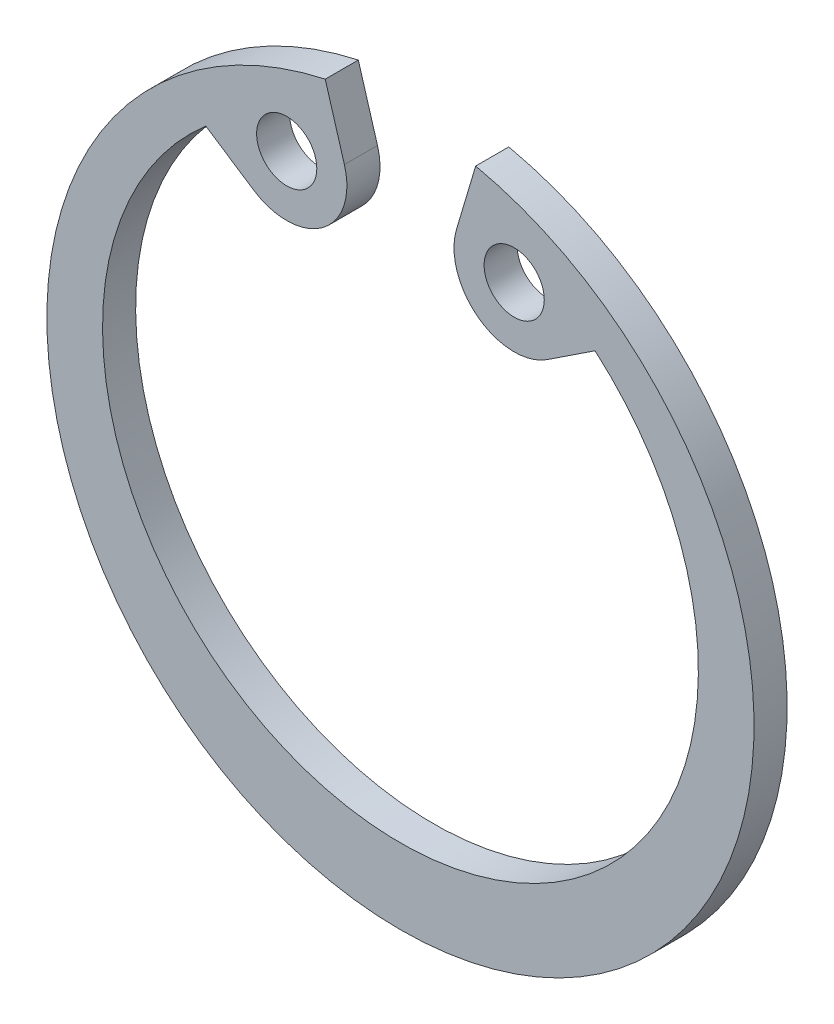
from build123d import *

# Parameters (mm, degrees)
SKETCH1_R          = 1
BASE_EXTRUDE_DEPTH = 1.1


with BuildPart() as part:
    # Sketch1 → Base-Extrude (new body)
    with BuildSketch(Plane.XY):
        with BuildLine():
            Line((-4.900527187, 2.532958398), (-4.263310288, 4.672906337))
            ThreePointArc((-4.263310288, 4.672906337), (-6.763310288, -18.558056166), (-9.263310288, 4.672906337))
            Line((-9.263310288, 4.672906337), (-8.62609339, 2.532958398))
            ThreePointArc((-8.62609339, 2.532958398), (-9.350970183, 0.356173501), (-11.644401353, 0.292830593))
            Line((-11.644401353, 0.292830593), (-13.229355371, 1.338627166))
            ThreePointArc((-13.229355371, 1.338627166), (-6.763310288, -16.058056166), (-0.297265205, 1.338627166))
            Line((-0.297265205, 1.338627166), (-1.882219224, 0.292830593))
            ThreePointArc((-1.882219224, 0.292830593), (-4.175650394, 0.356173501), (-4.900527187, 2.532958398))
        make_face()
        with Locations((-2.983703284, 1.962181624)):
            Circle(SKETCH1_R, mode=Mode.SUBTRACT)
        with Locations((-10.542917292, 1.962181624)):
            Circle(SKETCH1_R, mode=Mode.SUBTRACT)
    extrude(amount=BASE_EXTRUDE_DEPTH)


solid = part.part
